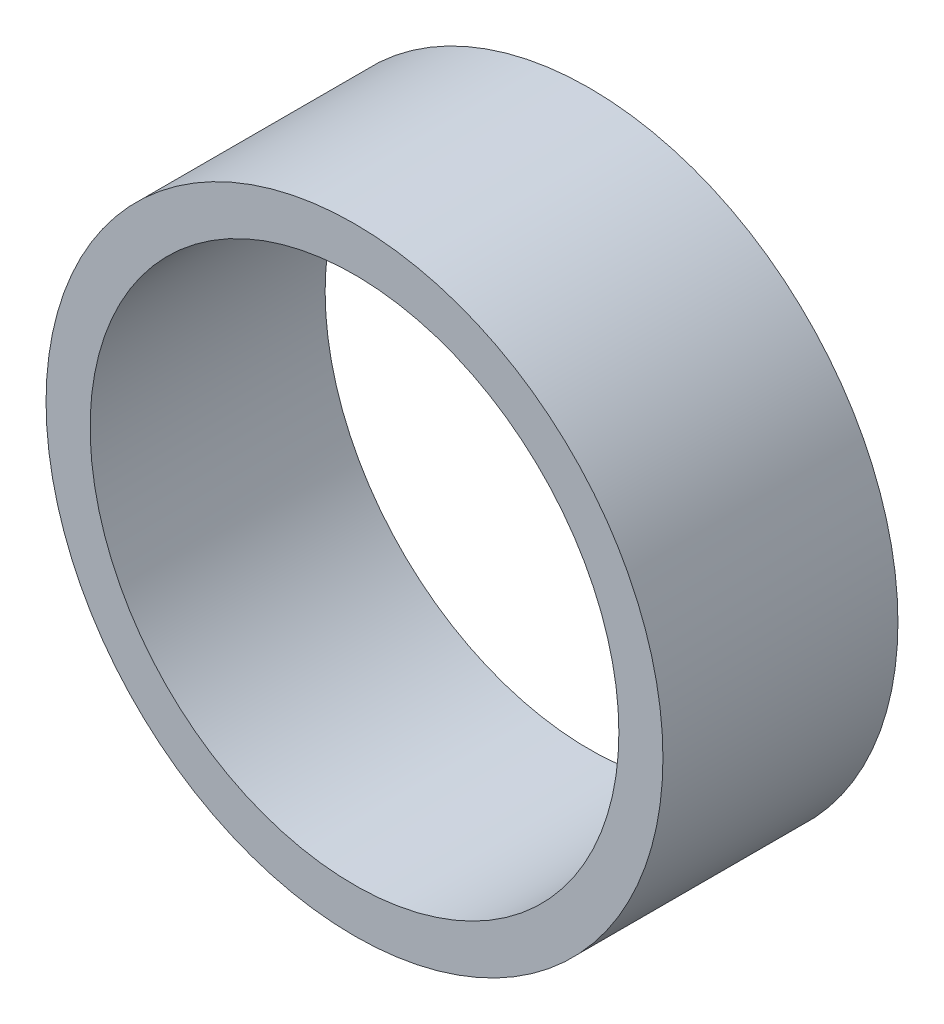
ISO-10303-21;
HEADER;
FILE_DESCRIPTION(('STEP AP214'),'2;1');
FILE_NAME('part.step','',(''),(''),'','','');
FILE_SCHEMA(('AUTOMOTIVE_DESIGN { 1 0 10303 214 1 1 1 1 }'));
ENDSEC;
DATA;
#1=APPLICATION_CONTEXT('core data for automotive mechanical design processes');
#2=APPLICATION_PROTOCOL_DEFINITION('international standard','automotive_design',2000,#1);
#3=PRODUCT_CONTEXT('',#1,'mechanical');
#4=PRODUCT('Part','Part','',(#3));
#5=PRODUCT_RELATED_PRODUCT_CATEGORY('part','',(#4));
#6=PRODUCT_DEFINITION_FORMATION('','',#4);
#7=PRODUCT_DEFINITION_CONTEXT('part definition',#1,'design');
#8=PRODUCT_DEFINITION('design','',#6,#7);
#9=PRODUCT_DEFINITION_SHAPE('','',#8);
#10=(LENGTH_UNIT() NAMED_UNIT(*) SI_UNIT(.MILLI.,.METRE.));
#11=(NAMED_UNIT(*) PLANE_ANGLE_UNIT() SI_UNIT($,.RADIAN.));
#12=(NAMED_UNIT(*) SI_UNIT($,.STERADIAN.) SOLID_ANGLE_UNIT());
#13=UNCERTAINTY_MEASURE_WITH_UNIT(LENGTH_MEASURE(1.E-05),#10,'distance_accuracy_value','');
#14=(GEOMETRIC_REPRESENTATION_CONTEXT(3) GLOBAL_UNCERTAINTY_ASSIGNED_CONTEXT((#13)) GLOBAL_UNIT_ASSIGNED_CONTEXT((#10,
#11,#12)) REPRESENTATION_CONTEXT('',''));
#15=CARTESIAN_POINT('',(0.,0.,0.));
#16=DIRECTION('',(0.,0.,1.));
#17=DIRECTION('',(1.,0.,0.));
#18=AXIS2_PLACEMENT_3D('',#15,#16,#17);
#19=CARTESIAN_POINT('',(4.5,0.,-37.698484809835));
#20=DIRECTION('',(0.,0.,1.));
#21=DIRECTION('',(1.,0.,0.));
#22=AXIS2_PLACEMENT_3D('',#19,#20,#21);
#23=CYLINDRICAL_SURFACE('',#22,10.5);
#24=CARTESIAN_POINT('',(4.5,0.,0.));
#25=DIRECTION('',(0.,0.,1.));
#26=DIRECTION('',(1.,0.,0.));
#27=AXIS2_PLACEMENT_3D('',#24,#25,#26);
#28=CIRCLE('',#27,10.5);
#29=CARTESIAN_POINT('',(15.,0.,0.));
#30=VERTEX_POINT('',#29);
#31=EDGE_CURVE('E36',#30,#30,#28,.T.);
#32=ORIENTED_EDGE('',*,*,#31,.F.);
#33=EDGE_LOOP('',(#32));
#34=FACE_BOUND('',#33,.T.);
#35=CARTESIAN_POINT('',(4.5,0.,-7.99999999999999));
#36=DIRECTION('',(0.,0.,-1.));
#37=DIRECTION('',(-1.,0.,0.));
#38=AXIS2_PLACEMENT_3D('',#35,#36,#37);
#39=CIRCLE('',#38,10.5);
#40=CARTESIAN_POINT('',(-6.,0.,-7.99999999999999));
#41=VERTEX_POINT('',#40);
#42=EDGE_CURVE('E45',#41,#41,#39,.F.);
#43=ORIENTED_EDGE('',*,*,#42,.T.);
#44=EDGE_LOOP('',(#43));
#45=FACE_BOUND('',#44,.T.);
#46=ADVANCED_FACE('F29',(#34,#45),#23,.T.);
#47=CARTESIAN_POINT('',(4.5,0.,-37.698484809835));
#48=DIRECTION('',(0.,0.,1.));
#49=DIRECTION('',(1.,0.,0.));
#50=AXIS2_PLACEMENT_3D('',#47,#48,#49);
#51=CYLINDRICAL_SURFACE('',#50,9.);
#52=CARTESIAN_POINT('',(4.5,0.,0.));
#53=DIRECTION('',(0.,0.,1.));
#54=DIRECTION('',(1.,0.,0.));
#55=AXIS2_PLACEMENT_3D('',#52,#53,#54);
#56=CIRCLE('',#55,9.);
#57=CARTESIAN_POINT('',(13.5,0.,0.));
#58=VERTEX_POINT('',#57);
#59=EDGE_CURVE('E40',#58,#58,#56,.T.);
#60=ORIENTED_EDGE('',*,*,#59,.T.);
#61=EDGE_LOOP('',(#60));
#62=FACE_BOUND('',#61,.T.);
#63=CARTESIAN_POINT('',(4.5,0.,-7.99999999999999));
#64=DIRECTION('',(0.,0.,-1.));
#65=DIRECTION('',(-1.,0.,0.));
#66=AXIS2_PLACEMENT_3D('',#63,#64,#65);
#67=CIRCLE('',#66,9.);
#68=CARTESIAN_POINT('',(-4.5,0.,-7.99999999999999));
#69=VERTEX_POINT('',#68);
#70=EDGE_CURVE('E10',#69,#69,#67,.F.);
#71=ORIENTED_EDGE('',*,*,#70,.F.);
#72=EDGE_LOOP('',(#71));
#73=FACE_BOUND('',#72,.T.);
#74=ADVANCED_FACE('F56',(#62,#73),#51,.F.);
#75=CARTESIAN_POINT('',(4.5,0.,0.));
#76=DIRECTION('',(0.,0.,1.));
#77=DIRECTION('',(1.,0.,0.));
#78=AXIS2_PLACEMENT_3D('',#75,#76,#77);
#79=PLANE('',#78);
#80=ORIENTED_EDGE('',*,*,#59,.F.);
#81=EDGE_LOOP('',(#80));
#82=FACE_BOUND('',#81,.T.);
#83=ORIENTED_EDGE('',*,*,#31,.T.);
#84=EDGE_LOOP('',(#83));
#85=FACE_BOUND('',#84,.T.);
#86=ADVANCED_FACE('F52',(#82,#85),#79,.T.);
#87=CARTESIAN_POINT('',(-17.7881605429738,12.9154887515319,-7.99999999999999));
#88=DIRECTION('',(0.,0.,-1.));
#89=DIRECTION('',(-1.,0.,0.));
#90=AXIS2_PLACEMENT_3D('',#87,#88,#89);
#91=PLANE('',#90);
#92=ORIENTED_EDGE('',*,*,#42,.F.);
#93=EDGE_LOOP('',(#92));
#94=FACE_BOUND('',#93,.T.);
#95=ORIENTED_EDGE('',*,*,#70,.T.);
#96=EDGE_LOOP('',(#95));
#97=FACE_BOUND('',#96,.T.);
#98=ADVANCED_FACE('F31',(#94,#97),#91,.T.);
#99=CLOSED_SHELL('',(#46,#74,#86,#98));
#100=MANIFOLD_SOLID_BREP('B2',#99);
#101=ADVANCED_BREP_SHAPE_REPRESENTATION('',(#18,#100),#14);
#102=SHAPE_DEFINITION_REPRESENTATION(#9,#101);
ENDSEC;
END-ISO-10303-21;
